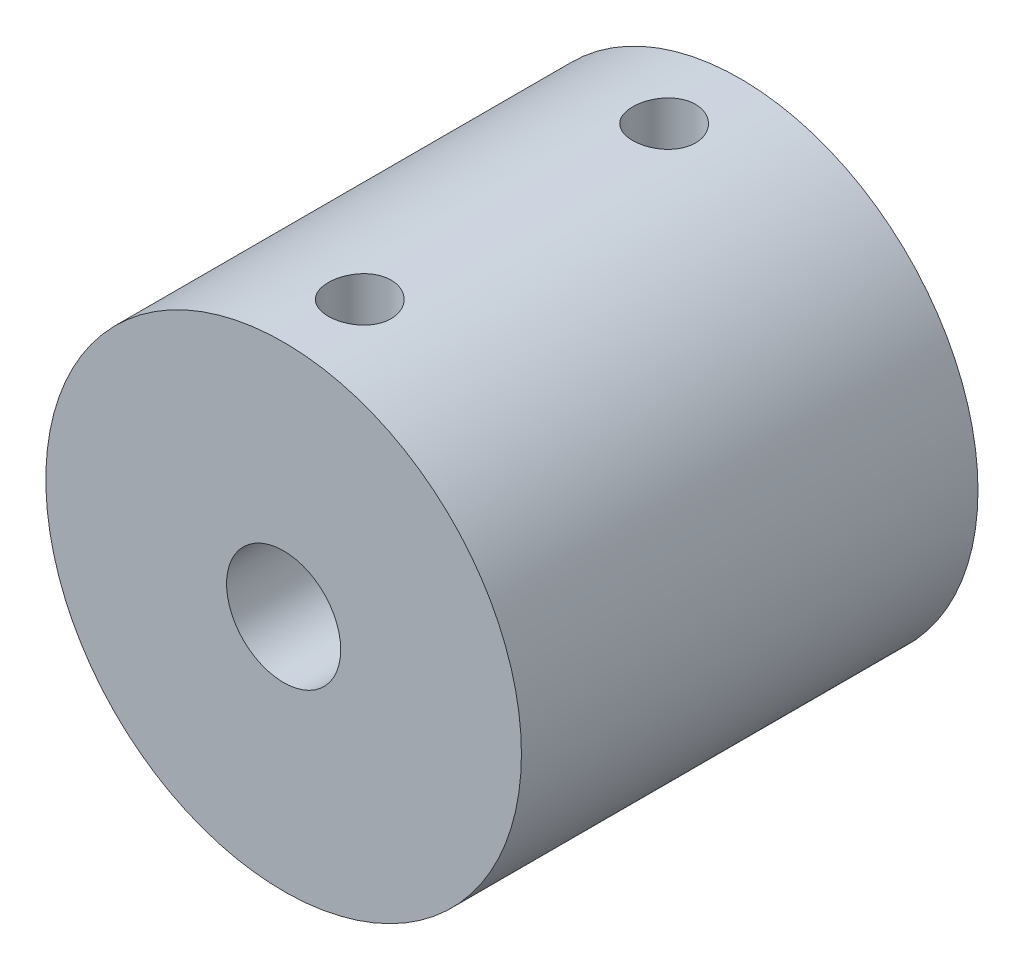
from build123d import *

# Parameters (mm, degrees)
SCHIZZO1_R                   = 12.5
SCHIZZO1_R_2                 = 3
ESTRUSIONE_ESTRUSIONE1_DEPTH = 24
FORO_FILETTATO_M4_1_REACH    = 38.841
FORO_FILETTATO_M4_1_BORE_R   = 1.65


with BuildPart() as part:
    # Schizzo1 → Estrusione-Estrusione1 (new body)
    with BuildSketch(Plane.XY):
        Circle(SCHIZZO1_R)
        Circle(SCHIZZO1_R_2, mode=Mode.SUBTRACT)
    extrude(amount=ESTRUSIONE_ESTRUSIONE1_DEPTH)

    # Foro filettato M4-1 bore → Foro filettato M4-1 (cut, up to next)
    with BuildSketch(Plane(origin=(0, 12.5, 0), x_dir=(1, 0, 0), z_dir=(0, 1, 0)), mode=Mode.PRIVATE) as foro_filettato_m4_1_sk1:
        with Locations((0, -4)):
            Circle(FORO_FILETTATO_M4_1_BORE_R)
    foro_filettato_m4_1_tool1 = extrude(foro_filettato_m4_1_sk1.sketch, amount=-FORO_FILETTATO_M4_1_REACH, mode=Mode.PRIVATE) & part.part
    # Foro filettato M4-1 bore → Foro filettato M4-1 (cut, up to next)
    with BuildSketch(Plane(origin=(0, 12.5, 0), x_dir=(1, 0, 0), z_dir=(0, 1, 0)), mode=Mode.PRIVATE) as foro_filettato_m4_1_sk2:
        with Locations((0, -20)):
            Circle(FORO_FILETTATO_M4_1_BORE_R)
    foro_filettato_m4_1_tool2 = extrude(foro_filettato_m4_1_sk2.sketch, amount=-FORO_FILETTATO_M4_1_REACH, mode=Mode.PRIVATE) & part.part
    add(foro_filettato_m4_1_tool1.solids().sort_by_distance((0, 12.5, 4))[0], mode=Mode.SUBTRACT)
    add(foro_filettato_m4_1_tool2.solids().sort_by_distance((0, 12.5, 20))[0], mode=Mode.SUBTRACT)


solid = part.part
